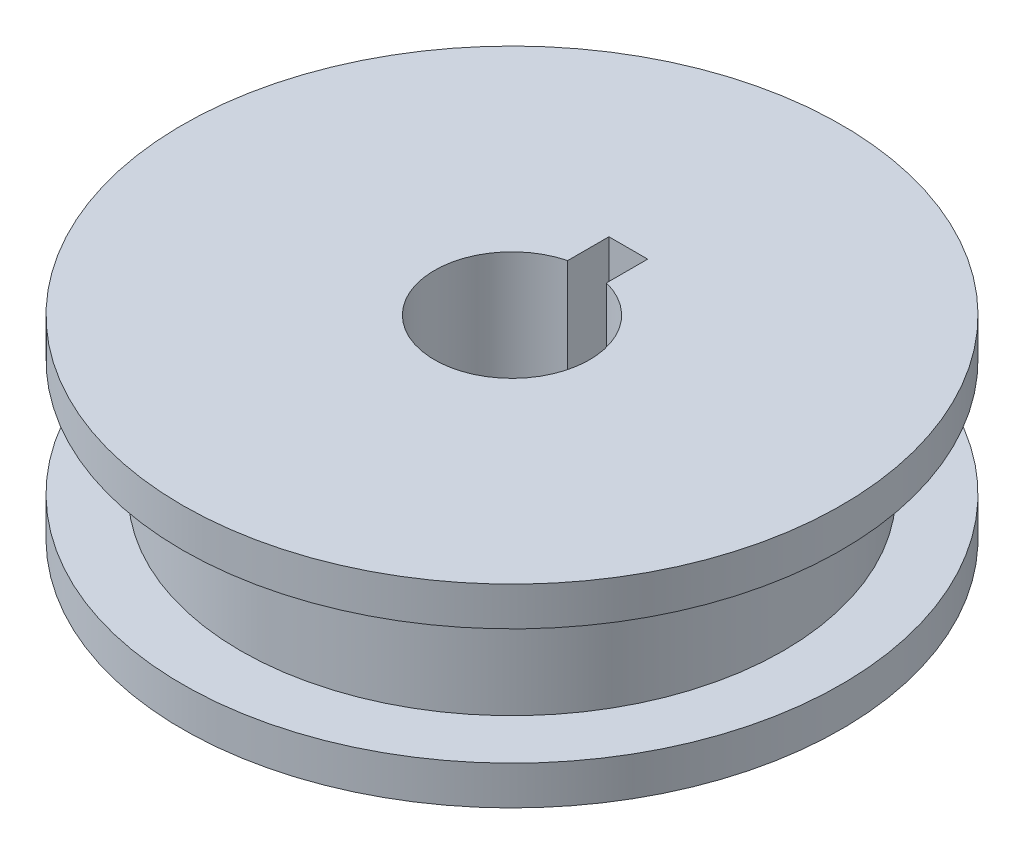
from build123d import *

# Parameters (mm, degrees)
BOSS_EXTRUDE1_DEPTH      = 3.175
BOSS_EXTRUDE1_DEPTH_BACK = 6.35
SKETCH1_R                = 22.225
SKETCH2_R                = 26.9875
BOSS_EXTRUDE2_DEPTH      = 3.175
BOSS_EXTRUDE3_START      = 3.175
SKETCH3_R                = 26.9875
BOSS_EXTRUDE3_DEPTH      = 3.175
CUT_EXTRUDE1_DEPTH       = 31.496
CUT_EXTRUDE1_DEPTH_BACK  = 54.737
SKETCH4_R                = 6.35
CUT_EXTRUDE2_DEPTH       = 42.336012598


with BuildPart() as part:
    # Sketch1 → Boss-Extrude1 (new, two sides: drawn at the far end of the back side and taken through both)
    with BuildSketch(Plane(origin=(0, 0, 0), x_dir=(1, 0, 0), z_dir=(0, 1, 0)).offset(-BOSS_EXTRUDE1_DEPTH_BACK)):
        with Locations(Location((0, 0, 0), (0, 0, 270))):
            Circle(SKETCH1_R)
    extrude(amount=BOSS_EXTRUDE1_DEPTH + BOSS_EXTRUDE1_DEPTH_BACK)

    # Sketch2 → Boss-Extrude2 (add)
    with BuildSketch(Plane.XZ.offset(6.35)):
        with Locations(Location((0, 0, 0), (0, 0, 270))):
            Circle(SKETCH2_R)
    extrude(amount=BOSS_EXTRUDE2_DEPTH)

    # Sketch3 → Boss-Extrude3 (add)
    with BuildSketch(Plane(origin=(0, 3.175, 0), x_dir=(-1, 0, 0), z_dir=(0, 1, 0)).offset(BOSS_EXTRUDE3_START)):
        with Locations(Location((0, 0, 0), (0, 0, 270))):
            Circle(SKETCH3_R)
    extrude(amount=-BOSS_EXTRUDE3_DEPTH)

    # Sketch4 → Cut-Extrude1 (cut, two sides: drawn at the far end of the back side and taken through both)
    with BuildSketch(Plane(origin=(0, 0, 0), x_dir=(1, 0, 0), z_dir=(0, 1, 0)).offset(-CUT_EXTRUDE1_DEPTH_BACK)):
        with Locations(Location((0, 0, 0), (0, 0, 90))):
            Circle(SKETCH4_R)
    extrude(amount=CUT_EXTRUDE1_DEPTH + CUT_EXTRUDE1_DEPTH_BACK, mode=Mode.SUBTRACT)

    # Sketch5 → Cut-Extrude2 (cut, through all)
    with BuildSketch(Plane(origin=(0, 6.35, 0), x_dir=(-1, 0, 0), z_dir=(0, 1, 0))):
        with BuildLine():
            Line((-1.5875, -6.35), (-1.5875, -9.525))
            Line((-1.5875, -9.525), (1.5875, -9.525))
            Line((1.5875, -9.525), (1.5875, -6.35))
            Line((1.5875, -6.35), (1.5875, -6.148361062))
            ThreePointArc((1.5875, -6.148361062), (0, -6.35), (-1.5875, -6.148361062))
            Line((-1.5875, -6.148361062), (-1.5875, -6.35))
        make_face()
    extrude(amount=-CUT_EXTRUDE2_DEPTH, mode=Mode.SUBTRACT)


solid = part.part
